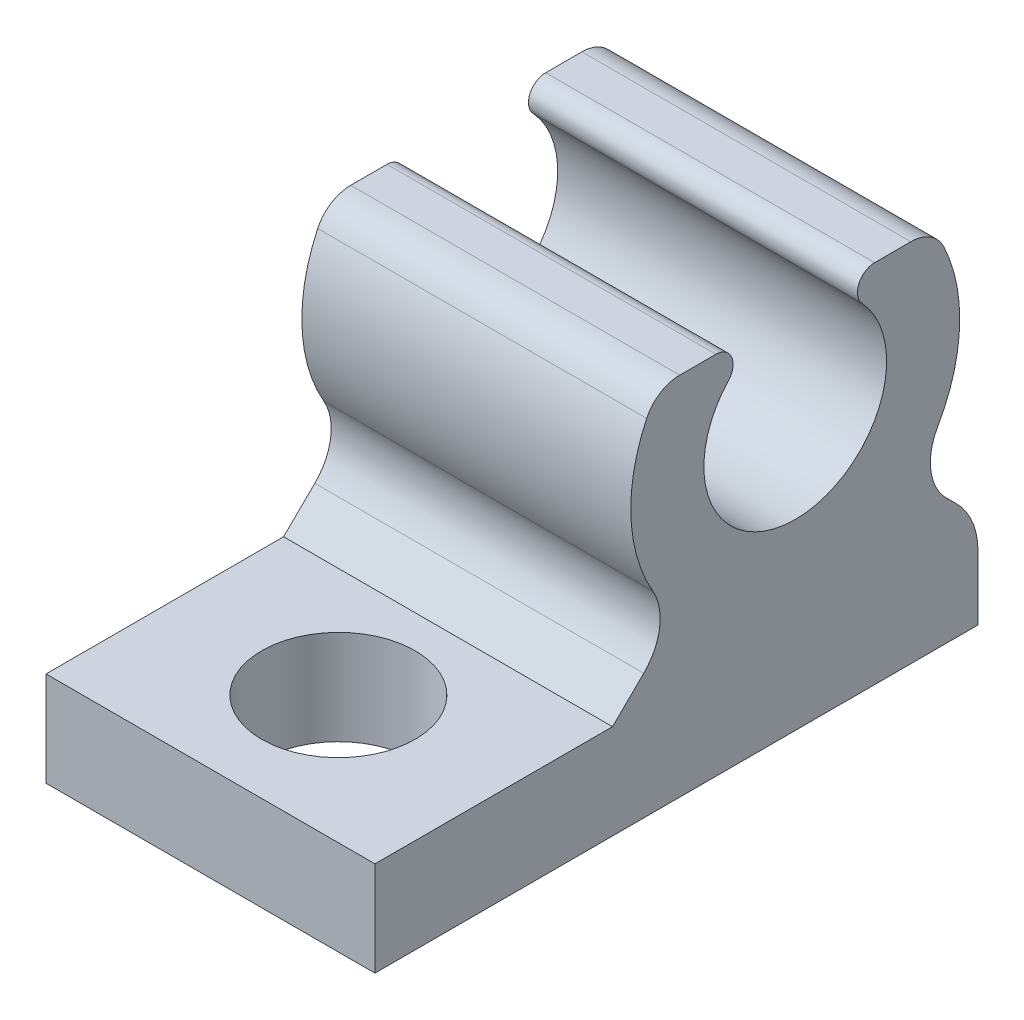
ISO-10303-21;
HEADER;
FILE_DESCRIPTION(('STEP AP214'),'2;1');
FILE_NAME('part.step','',(''),(''),'','','');
FILE_SCHEMA(('AUTOMOTIVE_DESIGN { 1 0 10303 214 1 1 1 1 }'));
ENDSEC;
DATA;
#1=APPLICATION_CONTEXT('core data for automotive mechanical design processes');
#2=APPLICATION_PROTOCOL_DEFINITION('international standard','automotive_design',2000,#1);
#3=PRODUCT_CONTEXT('',#1,'mechanical');
#4=PRODUCT('Part','Part','',(#3));
#5=PRODUCT_RELATED_PRODUCT_CATEGORY('part','',(#4));
#6=PRODUCT_DEFINITION_FORMATION('','',#4);
#7=PRODUCT_DEFINITION_CONTEXT('part definition',#1,'design');
#8=PRODUCT_DEFINITION('design','',#6,#7);
#9=PRODUCT_DEFINITION_SHAPE('','',#8);
#10=(LENGTH_UNIT() NAMED_UNIT(*) SI_UNIT(.MILLI.,.METRE.));
#11=(NAMED_UNIT(*) PLANE_ANGLE_UNIT() SI_UNIT($,.RADIAN.));
#12=(NAMED_UNIT(*) SI_UNIT($,.STERADIAN.) SOLID_ANGLE_UNIT());
#13=UNCERTAINTY_MEASURE_WITH_UNIT(LENGTH_MEASURE(1.E-05),#10,'distance_accuracy_value','');
#14=(GEOMETRIC_REPRESENTATION_CONTEXT(3) GLOBAL_UNCERTAINTY_ASSIGNED_CONTEXT((#13)) GLOBAL_UNIT_ASSIGNED_CONTEXT((#10,
#11,#12)) REPRESENTATION_CONTEXT('',''));
#15=CARTESIAN_POINT('',(0.,0.,0.));
#16=DIRECTION('',(0.,0.,1.));
#17=DIRECTION('',(1.,0.,0.));
#18=AXIS2_PLACEMENT_3D('',#15,#16,#17);
#19=CARTESIAN_POINT('',(-5.4,5.,-2.17157287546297));
#20=CARTESIAN_POINT('',(-5.10000000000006,5.,-2.17157287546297));
#21=CARTESIAN_POINT('',(-4.79999999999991,5.,-2.17157287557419));
#22=CARTESIAN_POINT('',(-1.50000000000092,5.,-2.17157287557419));
#23=CARTESIAN_POINT('',(1.50000000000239,5.,-2.17157287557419));
#24=CARTESIAN_POINT('',(4.79999999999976,5.,-2.17157287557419));
#25=CARTESIAN_POINT('',(5.10000000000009,5.,-2.17157287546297));
#26=CARTESIAN_POINT('',(5.39999999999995,5.,-2.17157287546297));
#27=CARTESIAN_POINT('',(-5.4,5.00000000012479,-1.69009893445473));
#28=CARTESIAN_POINT('',(-5.10000000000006,5.00000000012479,-1.69009893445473));
#29=CARTESIAN_POINT('',(-4.79999999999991,5.00000000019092,-1.69009893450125));
#30=CARTESIAN_POINT('',(-1.50000000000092,5.00000000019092,-1.69009893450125));
#31=CARTESIAN_POINT('',(1.50000000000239,5.00000000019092,-1.69009893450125));
#32=CARTESIAN_POINT('',(4.79999999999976,5.00000000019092,-1.69009893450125));
#33=CARTESIAN_POINT('',(5.10000000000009,5.00000000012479,-1.69009893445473));
#34=CARTESIAN_POINT('',(5.39999999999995,5.00000000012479,-1.69009893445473));
#35=CARTESIAN_POINT('',(-5.4,4.55837912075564,-1.49829654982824));
#36=CARTESIAN_POINT('',(-5.10000000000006,4.55837912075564,-1.49829654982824));
#37=CARTESIAN_POINT('',(-4.79999999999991,4.55837912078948,-1.49829654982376));
#38=CARTESIAN_POINT('',(-1.50000000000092,4.55837912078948,-1.49829654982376));
#39=CARTESIAN_POINT('',(1.50000000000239,4.55837912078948,-1.49829654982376));
#40=CARTESIAN_POINT('',(4.79999999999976,4.55837912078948,-1.49829654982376));
#41=CARTESIAN_POINT('',(5.10000000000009,4.55837912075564,-1.49829654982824));
#42=CARTESIAN_POINT('',(5.39999999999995,4.55837912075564,-1.49829654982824));
#43=CARTESIAN_POINT('',(-5.4,4.20652648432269,-1.82695576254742));
#44=CARTESIAN_POINT('',(-5.10000000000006,4.20652648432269,-1.82695576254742));
#45=CARTESIAN_POINT('',(-4.79999999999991,4.20652648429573,-1.82695576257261));
#46=CARTESIAN_POINT('',(-1.50000000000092,4.20652648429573,-1.82695576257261));
#47=CARTESIAN_POINT('',(1.50000000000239,4.20652648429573,-1.82695576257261));
#48=CARTESIAN_POINT('',(4.79999999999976,4.20652648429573,-1.82695576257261));
#49=CARTESIAN_POINT('',(5.10000000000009,4.20652648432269,-1.82695576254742));
#50=CARTESIAN_POINT('',(5.39999999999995,4.20652648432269,-1.82695576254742));
#51=(BOUNDED_SURFACE() B_SPLINE_SURFACE(3,3,((#19,#20,#21,#22,#23,#24,#25,#26),(#27,#28,#29,#30,
#31,#32,#33,#34),(#35,#36,#37,#38,#39,#40,#41,#42),(#43,#44,#45,#46,#47,#48,#49,#50)),
.UNSPECIFIED.,.F.,.F.,.F.) B_SPLINE_SURFACE_WITH_KNOTS((4,4),(4,2,2,4),(0.,1.),
(-0.0999999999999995,0.,0.999999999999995,1.09999999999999),
.UNSPECIFIED.) GEOMETRIC_REPRESENTATION_ITEM() RATIONAL_B_SPLINE_SURFACE(((1.,1.,1.,1.,1.,1.,1.,
1.),(0.598910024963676,0.598910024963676,0.598910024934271,0.598910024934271,0.598910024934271,
0.598910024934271,0.598910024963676,0.598910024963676),(0.598910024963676,0.598910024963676,
0.598910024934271,0.598910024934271,0.598910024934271,0.598910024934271,0.598910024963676,
0.598910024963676),(1.,1.,1.,1.,1.,1.,1.,1.))) REPRESENTATION_ITEM('') SURFACE());
#52=CARTESIAN_POINT('',(-5.4,4.20652648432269,-1.82695576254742));
#53=CARTESIAN_POINT('',(-5.10000000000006,4.20652648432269,-1.82695576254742));
#54=CARTESIAN_POINT('',(-4.79999999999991,4.20652648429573,-1.82695576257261));
#55=CARTESIAN_POINT('',(-1.50000000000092,4.20652648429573,-1.82695576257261));
#56=CARTESIAN_POINT('',(1.50000000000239,4.20652648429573,-1.82695576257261));
#57=CARTESIAN_POINT('',(4.79999999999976,4.20652648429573,-1.82695576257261));
#58=CARTESIAN_POINT('',(5.10000000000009,4.20652648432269,-1.82695576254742));
#59=CARTESIAN_POINT('',(5.39999999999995,4.20652648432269,-1.82695576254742));
#60=(BOUNDED_CURVE() B_SPLINE_CURVE(3,(#52,#53,#54,#55,#56,#57,#58,#59),.UNSPECIFIED.,.F.,
.F.) B_SPLINE_CURVE_WITH_KNOTS((4,2,2,4),(-0.0999999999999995,0.,0.999999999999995,
1.09999999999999),
.UNSPECIFIED.) CURVE() GEOMETRIC_REPRESENTATION_ITEM() RATIONAL_B_SPLINE_CURVE((1.,1.,1.,1.,1.,
1.,1.,1.)) REPRESENTATION_ITEM(''));
#61=CARTESIAN_POINT('',(4.5,4.20652648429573,-1.82695576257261));
#62=VERTEX_POINT('',#61);
#63=CARTESIAN_POINT('',(-4.5,4.20652648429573,-1.82695576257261));
#64=VERTEX_POINT('',#63);
#65=EDGE_CURVE('E461',#62,#64,#60,.F.);
#66=CARTESIAN_POINT('',(4.5,4.20652648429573,-1.82695576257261));
#67=CARTESIAN_POINT('',(4.5,4.55837912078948,-1.49829654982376));
#68=CARTESIAN_POINT('',(4.5,5.00000000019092,-1.69009893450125));
#69=CARTESIAN_POINT('',(4.5,5.,-2.17157287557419));
#70=(BOUNDED_CURVE() B_SPLINE_CURVE(3,(#66,#67,#68,#69),.UNSPECIFIED.,.F.,
.F.) B_SPLINE_CURVE_WITH_KNOTS((4,4),(0.,1.),
.UNSPECIFIED.) CURVE() GEOMETRIC_REPRESENTATION_ITEM() RATIONAL_B_SPLINE_CURVE((1.,
0.598910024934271,0.598910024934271,1.)) REPRESENTATION_ITEM(''));
#71=CARTESIAN_POINT('',(4.5,5.,-2.17157287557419));
#72=VERTEX_POINT('',#71);
#73=EDGE_CURVE('E385',#72,#62,#70,.F.);
#74=CARTESIAN_POINT('',(5.39999999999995,5.,-2.17157287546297));
#75=CARTESIAN_POINT('',(5.10000000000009,5.,-2.17157287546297));
#76=CARTESIAN_POINT('',(4.79999999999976,5.,-2.17157287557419));
#77=CARTESIAN_POINT('',(1.50000000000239,5.,-2.17157287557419));
#78=CARTESIAN_POINT('',(-1.50000000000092,5.,-2.17157287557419));
#79=CARTESIAN_POINT('',(-4.79999999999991,5.,-2.17157287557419));
#80=CARTESIAN_POINT('',(-5.10000000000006,5.,-2.17157287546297));
#81=CARTESIAN_POINT('',(-5.4,5.,-2.17157287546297));
#82=(BOUNDED_CURVE() B_SPLINE_CURVE(3,(#74,#75,#76,#77,#78,#79,#80,#81),.UNSPECIFIED.,.F.,
.F.) B_SPLINE_CURVE_WITH_KNOTS((4,2,2,4),(-0.0999999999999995,0.,0.999999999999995,
1.09999999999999),
.UNSPECIFIED.) CURVE() GEOMETRIC_REPRESENTATION_ITEM() RATIONAL_B_SPLINE_CURVE((1.,1.,1.,1.,1.,
1.,1.,1.)) REPRESENTATION_ITEM(''));
#83=CARTESIAN_POINT('',(-4.5,5.,-2.17157287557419));
#84=VERTEX_POINT('',#83);
#85=EDGE_CURVE('E459',#84,#72,#82,.F.);
#86=CARTESIAN_POINT('',(-4.5,5.,-2.17157287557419));
#87=CARTESIAN_POINT('',(-4.5,5.00000000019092,-1.69009893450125));
#88=CARTESIAN_POINT('',(-4.5,4.55837912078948,-1.49829654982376));
#89=CARTESIAN_POINT('',(-4.5,4.20652648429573,-1.82695576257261));
#90=(BOUNDED_CURVE() B_SPLINE_CURVE(3,(#86,#87,#88,#89),.UNSPECIFIED.,.F.,
.F.) B_SPLINE_CURVE_WITH_KNOTS((4,4),(0.,1.),
.UNSPECIFIED.) CURVE() GEOMETRIC_REPRESENTATION_ITEM() RATIONAL_B_SPLINE_CURVE((1.,
0.598910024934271,0.598910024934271,1.)) REPRESENTATION_ITEM(''));
#91=EDGE_CURVE('E382',#64,#84,#90,.F.);
#92=ORIENTED_EDGE('',*,*,#65,.F.);
#93=ORIENTED_EDGE('',*,*,#73,.F.);
#94=ORIENTED_EDGE('',*,*,#85,.F.);
#95=ORIENTED_EDGE('',*,*,#91,.F.);
#96=EDGE_LOOP('',(#92,#93,#94,#95));
#97=FACE_BOUND('',#96,.T.);
#98=ADVANCED_FACE('F38',(#97),#51,.T.);
#99=CARTESIAN_POINT('',(-5.4,4.20652648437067,1.8269557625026));
#100=CARTESIAN_POINT('',(-5.10000000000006,4.20652648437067,1.8269557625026));
#101=CARTESIAN_POINT('',(-4.79999999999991,4.20652648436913,1.82695576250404));
#102=CARTESIAN_POINT('',(-1.50000000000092,4.20652648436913,1.82695576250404));
#103=CARTESIAN_POINT('',(1.50000000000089,4.20652648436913,1.82695576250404));
#104=CARTESIAN_POINT('',(4.79999999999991,4.20652648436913,1.82695576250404));
#105=CARTESIAN_POINT('',(5.09999999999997,4.20652648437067,1.8269557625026));
#106=CARTESIAN_POINT('',(5.39999999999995,4.20652648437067,1.8269557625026));
#107=CARTESIAN_POINT('',(-5.4,4.55837912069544,1.49829654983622));
#108=CARTESIAN_POINT('',(-5.10000000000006,4.55837912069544,1.49829654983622));
#109=CARTESIAN_POINT('',(-4.79999999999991,4.55837912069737,1.49829654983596));
#110=CARTESIAN_POINT('',(-1.50000000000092,4.55837912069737,1.49829654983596));
#111=CARTESIAN_POINT('',(1.50000000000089,4.55837912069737,1.49829654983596));
#112=CARTESIAN_POINT('',(4.79999999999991,4.55837912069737,1.49829654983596));
#113=CARTESIAN_POINT('',(5.09999999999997,4.55837912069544,1.49829654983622));
#114=CARTESIAN_POINT('',(5.39999999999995,4.55837912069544,1.49829654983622));
#115=CARTESIAN_POINT('',(-5.4,5.00000000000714,1.69009893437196));
#116=CARTESIAN_POINT('',(-5.10000000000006,5.00000000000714,1.69009893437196));
#117=CARTESIAN_POINT('',(-4.79999999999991,5.00000000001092,1.69009893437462));
#118=CARTESIAN_POINT('',(-1.50000000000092,5.00000000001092,1.69009893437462));
#119=CARTESIAN_POINT('',(1.50000000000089,5.00000000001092,1.69009893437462));
#120=CARTESIAN_POINT('',(4.79999999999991,5.00000000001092,1.69009893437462));
#121=CARTESIAN_POINT('',(5.09999999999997,5.00000000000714,1.69009893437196));
#122=CARTESIAN_POINT('',(5.39999999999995,5.00000000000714,1.69009893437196));
#123=CARTESIAN_POINT('',(-5.4,5.,2.1715728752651));
#124=CARTESIAN_POINT('',(-5.10000000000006,5.,2.1715728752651));
#125=CARTESIAN_POINT('',(-4.79999999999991,5.,2.17157287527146));
#126=CARTESIAN_POINT('',(-1.50000000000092,5.,2.17157287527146));
#127=CARTESIAN_POINT('',(1.50000000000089,5.,2.17157287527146));
#128=CARTESIAN_POINT('',(4.79999999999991,5.,2.17157287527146));
#129=CARTESIAN_POINT('',(5.09999999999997,5.,2.1715728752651));
#130=CARTESIAN_POINT('',(5.39999999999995,5.,2.1715728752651));
#131=(BOUNDED_SURFACE() B_SPLINE_SURFACE(3,3,((#99,#100,#101,#102,#103,#104,#105,#106),(#107,
#108,#109,#110,#111,#112,#113,#114),(#115,#116,#117,#118,#119,#120,#121,#122),(#123,#124,#125,
#126,#127,#128,#129,#130)),.UNSPECIFIED.,.F.,.F.,.F.) B_SPLINE_SURFACE_WITH_KNOTS((4,4),(4,2,2,
4),(0.,1.),(-0.0999999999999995,0.,0.999999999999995,1.09999999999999),
.UNSPECIFIED.) GEOMETRIC_REPRESENTATION_ITEM() RATIONAL_B_SPLINE_SURFACE(((1.,1.,1.,1.,1.,1.,1.,
1.),(0.598910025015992,0.598910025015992,0.598910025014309,0.598910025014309,0.598910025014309,
0.598910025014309,0.598910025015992,0.598910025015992),(0.598910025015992,0.598910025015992,
0.598910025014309,0.598910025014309,0.598910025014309,0.598910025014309,0.598910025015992,
0.598910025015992),(1.,1.,1.,1.,1.,1.,1.,1.))) REPRESENTATION_ITEM('') SURFACE());
#132=CARTESIAN_POINT('',(5.39999999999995,4.20652648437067,1.8269557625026));
#133=CARTESIAN_POINT('',(5.09999999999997,4.20652648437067,1.8269557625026));
#134=CARTESIAN_POINT('',(4.79999999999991,4.20652648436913,1.82695576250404));
#135=CARTESIAN_POINT('',(1.50000000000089,4.20652648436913,1.82695576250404));
#136=CARTESIAN_POINT('',(-1.50000000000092,4.20652648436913,1.82695576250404));
#137=CARTESIAN_POINT('',(-4.79999999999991,4.20652648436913,1.82695576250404));
#138=CARTESIAN_POINT('',(-5.10000000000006,4.20652648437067,1.8269557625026));
#139=CARTESIAN_POINT('',(-5.4,4.20652648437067,1.8269557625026));
#140=(BOUNDED_CURVE() B_SPLINE_CURVE(3,(#132,#133,#134,#135,#136,#137,#138,#139),.UNSPECIFIED.,
.F.,.F.) B_SPLINE_CURVE_WITH_KNOTS((4,2,2,4),(-0.0999999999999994,0.,0.999999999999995,
1.09999999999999),
.UNSPECIFIED.) CURVE() GEOMETRIC_REPRESENTATION_ITEM() RATIONAL_B_SPLINE_CURVE((1.,1.,1.,1.,1.,
1.,1.,1.)) REPRESENTATION_ITEM(''));
#141=CARTESIAN_POINT('',(-4.5,4.20652648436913,1.82695576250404));
#142=VERTEX_POINT('',#141);
#143=CARTESIAN_POINT('',(4.5,4.20652648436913,1.82695576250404));
#144=VERTEX_POINT('',#143);
#145=EDGE_CURVE('E287',#142,#144,#140,.F.);
#146=CARTESIAN_POINT('',(-4.5,4.20652648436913,1.82695576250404));
#147=CARTESIAN_POINT('',(-4.5,4.55837912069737,1.49829654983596));
#148=CARTESIAN_POINT('',(-4.5,5.00000000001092,1.69009893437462));
#149=CARTESIAN_POINT('',(-4.5,5.,2.17157287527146));
#150=(BOUNDED_CURVE() B_SPLINE_CURVE(3,(#146,#147,#148,#149),.UNSPECIFIED.,.F.,
.F.) B_SPLINE_CURVE_WITH_KNOTS((4,4),(0.,1.),
.UNSPECIFIED.) CURVE() GEOMETRIC_REPRESENTATION_ITEM() RATIONAL_B_SPLINE_CURVE((1.,
0.598910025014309,0.598910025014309,1.)) REPRESENTATION_ITEM(''));
#151=CARTESIAN_POINT('',(-4.5,5.,2.17157287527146));
#152=VERTEX_POINT('',#151);
#153=EDGE_CURVE('E393',#152,#142,#150,.F.);
#154=CARTESIAN_POINT('',(-5.4,5.,2.1715728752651));
#155=CARTESIAN_POINT('',(-5.10000000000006,5.,2.1715728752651));
#156=CARTESIAN_POINT('',(-4.79999999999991,5.,2.17157287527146));
#157=CARTESIAN_POINT('',(-1.50000000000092,5.,2.17157287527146));
#158=CARTESIAN_POINT('',(1.50000000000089,5.,2.17157287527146));
#159=CARTESIAN_POINT('',(4.79999999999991,5.,2.17157287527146));
#160=CARTESIAN_POINT('',(5.09999999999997,5.,2.1715728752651));
#161=CARTESIAN_POINT('',(5.39999999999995,5.,2.1715728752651));
#162=(BOUNDED_CURVE() B_SPLINE_CURVE(3,(#154,#155,#156,#157,#158,#159,#160,#161),.UNSPECIFIED.,
.F.,.F.) B_SPLINE_CURVE_WITH_KNOTS((4,2,2,4),(-0.0999999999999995,0.,0.999999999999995,
1.09999999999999),
.UNSPECIFIED.) CURVE() GEOMETRIC_REPRESENTATION_ITEM() RATIONAL_B_SPLINE_CURVE((1.,1.,1.,1.,1.,
1.,1.,1.)) REPRESENTATION_ITEM(''));
#163=CARTESIAN_POINT('',(4.5,5.,2.17157287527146));
#164=VERTEX_POINT('',#163);
#165=EDGE_CURVE('E396',#164,#152,#162,.F.);
#166=CARTESIAN_POINT('',(4.5,5.,2.17157287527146));
#167=CARTESIAN_POINT('',(4.5,5.00000000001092,1.69009893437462));
#168=CARTESIAN_POINT('',(4.5,4.55837912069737,1.49829654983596));
#169=CARTESIAN_POINT('',(4.5,4.20652648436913,1.82695576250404));
#170=(BOUNDED_CURVE() B_SPLINE_CURVE(3,(#166,#167,#168,#169),.UNSPECIFIED.,.F.,
.F.) B_SPLINE_CURVE_WITH_KNOTS((4,4),(0.,1.),
.UNSPECIFIED.) CURVE() GEOMETRIC_REPRESENTATION_ITEM() RATIONAL_B_SPLINE_CURVE((1.,
0.598910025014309,0.598910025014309,1.)) REPRESENTATION_ITEM(''));
#171=EDGE_CURVE('E395',#144,#164,#170,.F.);
#172=ORIENTED_EDGE('',*,*,#145,.F.);
#173=ORIENTED_EDGE('',*,*,#153,.F.);
#174=ORIENTED_EDGE('',*,*,#165,.F.);
#175=ORIENTED_EDGE('',*,*,#171,.F.);
#176=EDGE_LOOP('',(#172,#173,#174,#175));
#177=FACE_BOUND('',#176,.T.);
#178=ADVANCED_FACE('F425',(#177),#131,.T.);
#179=CARTESIAN_POINT('',(-4.5,5.,5.));
#180=DIRECTION('',(0.,-1.,0.));
#181=DIRECTION('',(0.,0.,-1.));
#182=AXIS2_PLACEMENT_3D('',#179,#180,#181);
#183=PLANE('',#182);
#184=DIRECTION('',(0.,0.,-1.));
#185=VECTOR('',#184,1.);
#186=CARTESIAN_POINT('',(-4.5,5.,5.));
#187=LINE('',#186,#185);
#188=CARTESIAN_POINT('',(-4.5,5.,3.16227766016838));
#189=VERTEX_POINT('',#188);
#190=EDGE_CURVE('E328',#189,#152,#187,.T.);
#191=ORIENTED_EDGE('',*,*,#190,.F.);
#192=DIRECTION('',(-1.,0.,0.));
#193=VECTOR('',#192,1.);
#194=CARTESIAN_POINT('',(-4.5,5.,3.16227766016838));
#195=LINE('',#194,#193);
#196=CARTESIAN_POINT('',(4.5,5.,3.16227766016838));
#197=VERTEX_POINT('',#196);
#198=EDGE_CURVE('E361',#189,#197,#195,.F.);
#199=ORIENTED_EDGE('',*,*,#198,.T.);
#200=DIRECTION('',(0.,0.,-1.));
#201=VECTOR('',#200,1.);
#202=CARTESIAN_POINT('',(4.5,5.,5.));
#203=LINE('',#202,#201);
#204=EDGE_CURVE('E353',#197,#164,#203,.T.);
#205=ORIENTED_EDGE('',*,*,#204,.T.);
#206=ORIENTED_EDGE('',*,*,#165,.T.);
#207=EDGE_LOOP('',(#191,#199,#205,#206));
#208=FACE_BOUND('',#207,.T.);
#209=ADVANCED_FACE('F529',(#208),#183,.F.);
#210=CARTESIAN_POINT('',(4.5,5.,5.));
#211=DIRECTION('',(-1.,0.,0.));
#212=DIRECTION('',(0.,-1.,0.));
#213=AXIS2_PLACEMENT_3D('',#210,#211,#212);
#214=PLANE('',#213);
#215=DIRECTION('',(0.,1.,0.));
#216=VECTOR('',#215,1.);
#217=CARTESIAN_POINT('',(4.5,5.,-5.));
#218=LINE('',#217,#216);
#219=CARTESIAN_POINT('',(4.5,-5.,-5.));
#220=VERTEX_POINT('',#219);
#221=CARTESIAN_POINT('',(4.5,-3.24876140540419,-5.));
#222=VERTEX_POINT('',#221);
#223=EDGE_CURVE('E380',#220,#222,#218,.T.);
#224=ORIENTED_EDGE('',*,*,#223,.T.);
#225=CARTESIAN_POINT('',(4.5,-3.24876140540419,-3.));
#226=DIRECTION('',(-1.,0.,0.));
#227=DIRECTION('',(0.,-1.,0.));
#228=AXIS2_PLACEMENT_3D('',#225,#226,#227);
#229=CIRCLE('',#228,2.);
#230=CARTESIAN_POINT('',(4.5,-1.82171042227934,-4.40125853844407));
#231=VERTEX_POINT('',#230);
#232=EDGE_CURVE('E67',#222,#231,#229,.F.);
#233=ORIENTED_EDGE('',*,*,#232,.T.);
#234=DIRECTION('',(0.,0.700629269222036,0.713525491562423));
#235=VECTOR('',#234,1.);
#236=CARTESIAN_POINT('',(4.5,6.22678765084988,3.79538524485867));
#237=LINE('',#236,#235);
#238=CARTESIAN_POINT('',(4.5,-1.57028823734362,-4.14520851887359));
#239=VERTEX_POINT('',#238);
#240=EDGE_CURVE('E251',#231,#239,#237,.T.);
#241=ORIENTED_EDGE('',*,*,#240,.T.);
#242=CARTESIAN_POINT('',(4.5,-0.499999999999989,-5.19615242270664));
#243=DIRECTION('',(-1.,0.,0.));
#244=DIRECTION('',(0.,-1.,0.));
#245=AXIS2_PLACEMENT_3D('',#242,#243,#244);
#246=CIRCLE('',#245,1.5);
#247=CARTESIAN_POINT('',(4.5,0.250000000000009,-3.89711431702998));
#248=VERTEX_POINT('',#247);
#249=EDGE_CURVE('E266',#239,#248,#246,.T.);
#250=ORIENTED_EDGE('',*,*,#249,.T.);
#251=CARTESIAN_POINT('',(4.5,2.5,0.));
#252=DIRECTION('',(-1.,0.,0.));
#253=DIRECTION('',(0.,-1.,0.));
#254=AXIS2_PLACEMENT_3D('',#251,#252,#253);
#255=CIRCLE('',#254,4.5);
#256=CARTESIAN_POINT('',(4.5,4.42857142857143,-4.06578556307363));
#257=VERTEX_POINT('',#256);
#258=EDGE_CURVE('E265',#248,#257,#255,.F.);
#259=ORIENTED_EDGE('',*,*,#258,.T.);
#260=CARTESIAN_POINT('',(4.5,4.,-3.16227766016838));
#261=DIRECTION('',(-1.,0.,0.));
#262=DIRECTION('',(0.,-1.,0.));
#263=AXIS2_PLACEMENT_3D('',#260,#261,#262);
#264=CIRCLE('',#263,1.);
#265=CARTESIAN_POINT('',(4.5,5.,-3.16227766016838));
#266=VERTEX_POINT('',#265);
#267=EDGE_CURVE('E358',#257,#266,#264,.F.);
#268=ORIENTED_EDGE('',*,*,#267,.T.);
#269=EDGE_CURVE('E330',#72,#266,#203,.T.);
#270=ORIENTED_EDGE('',*,*,#269,.F.);
#271=ORIENTED_EDGE('',*,*,#73,.T.);
#272=CARTESIAN_POINT('',(4.5,2.5,0.));
#273=DIRECTION('',(1.,0.,0.));
#274=DIRECTION('',(0.,0.,-1.));
#275=AXIS2_PLACEMENT_3D('',#272,#273,#274);
#276=CIRCLE('',#275,2.5);
#277=EDGE_CURVE('E270',#144,#62,#276,.T.);
#278=ORIENTED_EDGE('',*,*,#277,.F.);
#279=ORIENTED_EDGE('',*,*,#171,.T.);
#280=ORIENTED_EDGE('',*,*,#204,.F.);
#281=CARTESIAN_POINT('',(4.5,4.,3.16227766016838));
#282=DIRECTION('',(-1.,0.,0.));
#283=DIRECTION('',(0.,-1.,0.));
#284=AXIS2_PLACEMENT_3D('',#281,#282,#283);
#285=CIRCLE('',#284,1.);
#286=CARTESIAN_POINT('',(4.5,4.42857142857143,4.06578556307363));
#287=VERTEX_POINT('',#286);
#288=EDGE_CURVE('E352',#197,#287,#285,.F.);
#289=ORIENTED_EDGE('',*,*,#288,.T.);
#290=CARTESIAN_POINT('',(4.5,0.250000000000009,3.89711431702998));
#291=VERTEX_POINT('',#290);
#292=EDGE_CURVE('E262',#287,#291,#255,.F.);
#293=ORIENTED_EDGE('',*,*,#292,.T.);
#294=CARTESIAN_POINT('',(4.5,-0.499999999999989,5.19615242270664));
#295=DIRECTION('',(-1.,0.,0.));
#296=DIRECTION('',(0.,-1.,0.));
#297=AXIS2_PLACEMENT_3D('',#294,#295,#296);
#298=CIRCLE('',#297,1.5);
#299=CARTESIAN_POINT('',(4.5,-1.57028823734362,4.14520851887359));
#300=VERTEX_POINT('',#299);
#301=EDGE_CURVE('E259',#291,#300,#298,.T.);
#302=ORIENTED_EDGE('',*,*,#301,.T.);
#303=DIRECTION('',(0.,-0.700629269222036,0.713525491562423));
#304=VECTOR('',#303,1.);
#305=CARTESIAN_POINT('',(4.5,1.22761921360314,1.2958010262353));
#306=LINE('',#305,#304);
#307=CARTESIAN_POINT('',(4.5,-2.40963026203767,5.));
#308=VERTEX_POINT('',#307);
#309=EDGE_CURVE('E223',#300,#308,#306,.T.);
#310=ORIENTED_EDGE('',*,*,#309,.T.);
#311=DIRECTION('',(0.,0.,-1.));
#312=VECTOR('',#311,1.);
#313=CARTESIAN_POINT('',(4.5,-2.40963026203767,11.5));
#314=LINE('',#313,#312);
#315=CARTESIAN_POINT('',(4.5,-2.40963026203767,11.5));
#316=VERTEX_POINT('',#315);
#317=EDGE_CURVE('E201',#316,#308,#314,.T.);
#318=ORIENTED_EDGE('',*,*,#317,.F.);
#319=DIRECTION('',(0.,1.,0.));
#320=VECTOR('',#319,1.);
#321=CARTESIAN_POINT('',(4.5,-5.,11.5));
#322=LINE('',#321,#320);
#323=CARTESIAN_POINT('',(4.5,-5.,11.5));
#324=VERTEX_POINT('',#323);
#325=EDGE_CURVE('E209',#324,#316,#322,.T.);
#326=ORIENTED_EDGE('',*,*,#325,.F.);
#327=DIRECTION('',(0.,0.,-1.));
#328=VECTOR('',#327,1.);
#329=CARTESIAN_POINT('',(4.5,-5.,5.));
#330=LINE('',#329,#328);
#331=EDGE_CURVE('E377',#324,#220,#330,.T.);
#332=ORIENTED_EDGE('',*,*,#331,.T.);
#333=EDGE_LOOP('',(#224,#233,#241,#250,#259,#268,#270,#271,#278,#279,#280,#289,#293,#302,#310,
#318,#326,#332));
#334=FACE_BOUND('',#333,.T.);
#335=ADVANCED_FACE('F221',(#334),#214,.F.);
#336=ORIENTED_EDGE('',*,*,#269,.T.);
#337=DIRECTION('',(-1.,0.,0.));
#338=VECTOR('',#337,1.);
#339=CARTESIAN_POINT('',(-4.5,5.,-3.16227766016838));
#340=LINE('',#339,#338);
#341=CARTESIAN_POINT('',(-4.5,5.,-3.16227766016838));
#342=VERTEX_POINT('',#341);
#343=EDGE_CURVE('E341',#266,#342,#340,.T.);
#344=ORIENTED_EDGE('',*,*,#343,.T.);
#345=EDGE_CURVE('E318',#84,#342,#187,.T.);
#346=ORIENTED_EDGE('',*,*,#345,.F.);
#347=ORIENTED_EDGE('',*,*,#85,.T.);
#348=EDGE_LOOP('',(#336,#344,#346,#347));
#349=FACE_BOUND('',#348,.T.);
#350=ADVANCED_FACE('F467',(#349),#183,.F.);
#351=CARTESIAN_POINT('',(-4.5,5.,5.));
#352=DIRECTION('',(1.,0.,0.));
#353=DIRECTION('',(0.,1.,0.));
#354=AXIS2_PLACEMENT_3D('',#351,#352,#353);
#355=PLANE('',#354);
#356=DIRECTION('',(0.,-0.700629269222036,-0.713525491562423));
#357=VECTOR('',#356,1.);
#358=CARTESIAN_POINT('',(-4.5,6.22678765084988,3.79538524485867));
#359=LINE('',#358,#357);
#360=CARTESIAN_POINT('',(-4.5,-1.57028823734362,-4.14520851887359));
#361=VERTEX_POINT('',#360);
#362=CARTESIAN_POINT('',(-4.5,-1.82171042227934,-4.40125853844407));
#363=VERTEX_POINT('',#362);
#364=EDGE_CURVE('E248',#361,#363,#359,.T.);
#365=ORIENTED_EDGE('',*,*,#364,.T.);
#366=CARTESIAN_POINT('',(-4.5,-3.24876140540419,-3.));
#367=DIRECTION('',(1.,0.,0.));
#368=DIRECTION('',(0.,1.,0.));
#369=AXIS2_PLACEMENT_3D('',#366,#367,#368);
#370=CIRCLE('',#369,2.);
#371=CARTESIAN_POINT('',(-4.5,-3.24876140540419,-5.));
#372=VERTEX_POINT('',#371);
#373=EDGE_CURVE('E11',#363,#372,#370,.F.);
#374=ORIENTED_EDGE('',*,*,#373,.T.);
#375=DIRECTION('',(0.,-1.,0.));
#376=VECTOR('',#375,1.);
#377=CARTESIAN_POINT('',(-4.5,5.,-5.));
#378=LINE('',#377,#376);
#379=CARTESIAN_POINT('',(-4.5,-5.,-5.));
#380=VERTEX_POINT('',#379);
#381=EDGE_CURVE('E378',#372,#380,#378,.T.);
#382=ORIENTED_EDGE('',*,*,#381,.T.);
#383=DIRECTION('',(0.,0.,-1.));
#384=VECTOR('',#383,1.);
#385=CARTESIAN_POINT('',(-4.5,-5.,5.));
#386=LINE('',#385,#384);
#387=CARTESIAN_POINT('',(-4.5,-5.,11.5));
#388=VERTEX_POINT('',#387);
#389=EDGE_CURVE('E329',#388,#380,#386,.T.);
#390=ORIENTED_EDGE('',*,*,#389,.F.);
#391=DIRECTION('',(0.,-1.,0.));
#392=VECTOR('',#391,1.);
#393=CARTESIAN_POINT('',(-4.5,-2.40963026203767,11.5));
#394=LINE('',#393,#392);
#395=CARTESIAN_POINT('',(-4.5,-2.40963026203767,11.5));
#396=VERTEX_POINT('',#395);
#397=EDGE_CURVE('E208',#396,#388,#394,.T.);
#398=ORIENTED_EDGE('',*,*,#397,.F.);
#399=DIRECTION('',(0.,0.,-1.));
#400=VECTOR('',#399,1.);
#401=CARTESIAN_POINT('',(-4.5,-2.40963026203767,11.5));
#402=LINE('',#401,#400);
#403=CARTESIAN_POINT('',(-4.5,-2.40963026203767,5.));
#404=VERTEX_POINT('',#403);
#405=EDGE_CURVE('E203',#396,#404,#402,.T.);
#406=ORIENTED_EDGE('',*,*,#405,.T.);
#407=DIRECTION('',(0.,0.700629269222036,-0.713525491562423));
#408=VECTOR('',#407,1.);
#409=CARTESIAN_POINT('',(-4.5,1.22761921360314,1.2958010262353));
#410=LINE('',#409,#408);
#411=CARTESIAN_POINT('',(-4.5,-1.57028823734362,4.14520851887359));
#412=VERTEX_POINT('',#411);
#413=EDGE_CURVE('E254',#404,#412,#410,.T.);
#414=ORIENTED_EDGE('',*,*,#413,.T.);
#415=CARTESIAN_POINT('',(-4.5,-0.499999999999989,5.19615242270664));
#416=DIRECTION('',(1.,0.,0.));
#417=DIRECTION('',(0.,1.,0.));
#418=AXIS2_PLACEMENT_3D('',#415,#416,#417);
#419=CIRCLE('',#418,1.5);
#420=CARTESIAN_POINT('',(-4.5,0.250000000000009,3.89711431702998));
#421=VERTEX_POINT('',#420);
#422=EDGE_CURVE('E399',#412,#421,#419,.T.);
#423=ORIENTED_EDGE('',*,*,#422,.T.);
#424=CARTESIAN_POINT('',(-4.5,2.5,0.));
#425=DIRECTION('',(1.,0.,0.));
#426=DIRECTION('',(0.,1.,0.));
#427=AXIS2_PLACEMENT_3D('',#424,#425,#426);
#428=CIRCLE('',#427,4.5);
#429=CARTESIAN_POINT('',(-4.5,4.42857142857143,4.06578556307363));
#430=VERTEX_POINT('',#429);
#431=EDGE_CURVE('E388',#421,#430,#428,.F.);
#432=ORIENTED_EDGE('',*,*,#431,.T.);
#433=CARTESIAN_POINT('',(-4.5,4.,3.16227766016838));
#434=DIRECTION('',(1.,0.,0.));
#435=DIRECTION('',(0.,1.,0.));
#436=AXIS2_PLACEMENT_3D('',#433,#434,#435);
#437=CIRCLE('',#436,1.);
#438=EDGE_CURVE('E343',#430,#189,#437,.F.);
#439=ORIENTED_EDGE('',*,*,#438,.T.);
#440=ORIENTED_EDGE('',*,*,#190,.T.);
#441=ORIENTED_EDGE('',*,*,#153,.T.);
#442=CARTESIAN_POINT('',(-4.5,2.5,0.));
#443=DIRECTION('',(1.,0.,0.));
#444=DIRECTION('',(0.,0.,-1.));
#445=AXIS2_PLACEMENT_3D('',#442,#443,#444);
#446=CIRCLE('',#445,2.5);
#447=EDGE_CURVE('E280',#142,#64,#446,.T.);
#448=ORIENTED_EDGE('',*,*,#447,.T.);
#449=ORIENTED_EDGE('',*,*,#91,.T.);
#450=ORIENTED_EDGE('',*,*,#345,.T.);
#451=CARTESIAN_POINT('',(-4.5,4.,-3.16227766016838));
#452=DIRECTION('',(1.,0.,0.));
#453=DIRECTION('',(0.,1.,0.));
#454=AXIS2_PLACEMENT_3D('',#451,#452,#453);
#455=CIRCLE('',#454,1.);
#456=CARTESIAN_POINT('',(-4.5,4.42857142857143,-4.06578556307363));
#457=VERTEX_POINT('',#456);
#458=EDGE_CURVE('E346',#342,#457,#455,.F.);
#459=ORIENTED_EDGE('',*,*,#458,.T.);
#460=CARTESIAN_POINT('',(-4.5,0.250000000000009,-3.89711431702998));
#461=VERTEX_POINT('',#460);
#462=EDGE_CURVE('E386',#457,#461,#428,.F.);
#463=ORIENTED_EDGE('',*,*,#462,.T.);
#464=CARTESIAN_POINT('',(-4.5,-0.499999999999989,-5.19615242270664));
#465=DIRECTION('',(1.,0.,0.));
#466=DIRECTION('',(0.,1.,0.));
#467=AXIS2_PLACEMENT_3D('',#464,#465,#466);
#468=CIRCLE('',#467,1.5);
#469=EDGE_CURVE('E387',#461,#361,#468,.T.);
#470=ORIENTED_EDGE('',*,*,#469,.T.);
#471=EDGE_LOOP('',(#365,#374,#382,#390,#398,#406,#414,#423,#432,#439,#440,#441,#448,#449,#450,
#459,#463,#470));
#472=FACE_BOUND('',#471,.T.);
#473=ADVANCED_FACE('F483',(#472),#355,.F.);
#474=CARTESIAN_POINT('',(-4.5,-5.,5.));
#475=DIRECTION('',(0.,1.,0.));
#476=DIRECTION('',(0.,0.,1.));
#477=AXIS2_PLACEMENT_3D('',#474,#475,#476);
#478=PLANE('',#477);
#479=CARTESIAN_POINT('',(0.,-5.,8.));
#480=DIRECTION('',(0.,1.,0.));
#481=DIRECTION('',(0.,0.,1.));
#482=AXIS2_PLACEMENT_3D('',#479,#480,#481);
#483=CIRCLE('',#482,2.1);
#484=CARTESIAN_POINT('',(0.,-5.,10.1));
#485=VERTEX_POINT('',#484);
#486=EDGE_CURVE('E218',#485,#485,#483,.T.);
#487=ORIENTED_EDGE('',*,*,#486,.T.);
#488=EDGE_LOOP('',(#487));
#489=FACE_BOUND('',#488,.T.);
#490=DIRECTION('',(1.,0.,0.));
#491=VECTOR('',#490,1.);
#492=CARTESIAN_POINT('',(-4.5,-5.,-5.));
#493=LINE('',#492,#491);
#494=EDGE_CURVE('E375',#380,#220,#493,.T.);
#495=ORIENTED_EDGE('',*,*,#494,.T.);
#496=ORIENTED_EDGE('',*,*,#331,.F.);
#497=DIRECTION('',(1.,0.,0.));
#498=VECTOR('',#497,1.);
#499=CARTESIAN_POINT('',(-4.5,-5.,11.5));
#500=LINE('',#499,#498);
#501=EDGE_CURVE('E215',#388,#324,#500,.T.);
#502=ORIENTED_EDGE('',*,*,#501,.F.);
#503=ORIENTED_EDGE('',*,*,#389,.T.);
#504=EDGE_LOOP('',(#495,#496,#502,#503));
#505=FACE_BOUND('',#504,.T.);
#506=ADVANCED_FACE('F501',(#489,#505),#478,.F.);
#507=CARTESIAN_POINT('',(4.5,-5.,-5.));
#508=DIRECTION('',(0.,0.,1.));
#509=DIRECTION('',(1.,0.,0.));
#510=AXIS2_PLACEMENT_3D('',#507,#508,#509);
#511=PLANE('',#510);
#512=ORIENTED_EDGE('',*,*,#381,.F.);
#513=DIRECTION('',(1.,0.,0.));
#514=VECTOR('',#513,1.);
#515=CARTESIAN_POINT('',(4.5,-3.24876140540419,-5.));
#516=LINE('',#515,#514);
#517=EDGE_CURVE('E368',#372,#222,#516,.T.);
#518=ORIENTED_EDGE('',*,*,#517,.T.);
#519=ORIENTED_EDGE('',*,*,#223,.F.);
#520=ORIENTED_EDGE('',*,*,#494,.F.);
#521=EDGE_LOOP('',(#512,#518,#519,#520));
#522=FACE_BOUND('',#521,.T.);
#523=ADVANCED_FACE('F306',(#522),#511,.F.);
#524=CARTESIAN_POINT('',(-4.5,2.5,0.));
#525=DIRECTION('',(1.,0.,0.));
#526=DIRECTION('',(0.,0.,-1.));
#527=AXIS2_PLACEMENT_3D('',#524,#525,#526);
#528=CYLINDRICAL_SURFACE('',#527,2.5);
#529=ORIENTED_EDGE('',*,*,#277,.T.);
#530=ORIENTED_EDGE('',*,*,#65,.T.);
#531=ORIENTED_EDGE('',*,*,#447,.F.);
#532=ORIENTED_EDGE('',*,*,#145,.T.);
#533=EDGE_LOOP('',(#529,#530,#531,#532));
#534=FACE_BOUND('',#533,.T.);
#535=ADVANCED_FACE('F295',(#534),#528,.F.);
#536=CARTESIAN_POINT('',(25.6634635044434,2.5,0.));
#537=DIRECTION('',(-1.,0.,0.));
#538=DIRECTION('',(0.,0.,1.));
#539=AXIS2_PLACEMENT_3D('',#536,#537,#538);
#540=CYLINDRICAL_SURFACE('',#539,4.5);
#541=ORIENTED_EDGE('',*,*,#462,.F.);
#542=DIRECTION('',(-1.,0.,0.));
#543=VECTOR('',#542,1.);
#544=CARTESIAN_POINT('',(25.6634635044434,4.42857142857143,-4.06578556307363));
#545=LINE('',#544,#543);
#546=EDGE_CURVE('E349',#457,#257,#545,.F.);
#547=ORIENTED_EDGE('',*,*,#546,.T.);
#548=ORIENTED_EDGE('',*,*,#258,.F.);
#549=DIRECTION('',(-1.,0.,0.));
#550=VECTOR('',#549,1.);
#551=CARTESIAN_POINT('',(25.6634635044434,0.250000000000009,-3.89711431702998));
#552=LINE('',#551,#550);
#553=EDGE_CURVE('E240',#248,#461,#552,.T.);
#554=ORIENTED_EDGE('',*,*,#553,.T.);
#555=EDGE_LOOP('',(#541,#547,#548,#554));
#556=FACE_BOUND('',#555,.T.);
#557=ADVANCED_FACE('F305',(#556),#540,.T.);
#558=CARTESIAN_POINT('',(25.6634635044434,-1.57028823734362,-4.14520851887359));
#559=DIRECTION('',(0.,-0.713525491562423,0.700629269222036));
#560=DIRECTION('',(0.,-0.700629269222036,-0.713525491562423));
#561=AXIS2_PLACEMENT_3D('',#558,#559,#560);
#562=PLANE('',#561);
#563=ORIENTED_EDGE('',*,*,#240,.F.);
#564=DIRECTION('',(1.,0.,0.));
#565=VECTOR('',#564,1.);
#566=CARTESIAN_POINT('',(25.6634635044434,-1.82171042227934,-4.40125853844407));
#567=LINE('',#566,#565);
#568=EDGE_CURVE('E47',#231,#363,#567,.F.);
#569=ORIENTED_EDGE('',*,*,#568,.T.);
#570=ORIENTED_EDGE('',*,*,#364,.F.);
#571=DIRECTION('',(-1.,0.,0.));
#572=VECTOR('',#571,1.);
#573=CARTESIAN_POINT('',(25.6634635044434,-1.57028823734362,-4.14520851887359));
#574=LINE('',#573,#572);
#575=EDGE_CURVE('E244',#239,#361,#574,.T.);
#576=ORIENTED_EDGE('',*,*,#575,.F.);
#577=EDGE_LOOP('',(#563,#569,#570,#576));
#578=FACE_BOUND('',#577,.T.);
#579=ADVANCED_FACE('F307',(#578),#562,.F.);
#580=CARTESIAN_POINT('',(25.6634635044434,-0.499999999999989,-5.19615242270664));
#581=DIRECTION('',(-1.,0.,0.));
#582=DIRECTION('',(0.,0.,1.));
#583=AXIS2_PLACEMENT_3D('',#580,#581,#582);
#584=CYLINDRICAL_SURFACE('',#583,1.5);
#585=ORIENTED_EDGE('',*,*,#249,.F.);
#586=ORIENTED_EDGE('',*,*,#575,.T.);
#587=ORIENTED_EDGE('',*,*,#469,.F.);
#588=ORIENTED_EDGE('',*,*,#553,.F.);
#589=EDGE_LOOP('',(#585,#586,#587,#588));
#590=FACE_BOUND('',#589,.T.);
#591=ADVANCED_FACE('F591',(#590),#584,.F.);
#592=ORIENTED_EDGE('',*,*,#292,.F.);
#593=DIRECTION('',(-1.,0.,0.));
#594=VECTOR('',#593,1.);
#595=CARTESIAN_POINT('',(25.6634635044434,4.42857142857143,4.06578556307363));
#596=LINE('',#595,#594);
#597=EDGE_CURVE('E365',#287,#430,#596,.T.);
#598=ORIENTED_EDGE('',*,*,#597,.T.);
#599=ORIENTED_EDGE('',*,*,#431,.F.);
#600=DIRECTION('',(-1.,0.,0.));
#601=VECTOR('',#600,1.);
#602=CARTESIAN_POINT('',(25.6634635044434,0.250000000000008,3.89711431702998));
#603=LINE('',#602,#601);
#604=EDGE_CURVE('E231',#291,#421,#603,.T.);
#605=ORIENTED_EDGE('',*,*,#604,.F.);
#606=EDGE_LOOP('',(#592,#598,#599,#605));
#607=FACE_BOUND('',#606,.T.);
#608=ADVANCED_FACE('F551',(#607),#540,.T.);
#609=CARTESIAN_POINT('',(25.6634635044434,-0.499999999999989,5.19615242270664));
#610=DIRECTION('',(-1.,0.,0.));
#611=DIRECTION('',(0.,0.,1.));
#612=AXIS2_PLACEMENT_3D('',#609,#610,#611);
#613=CYLINDRICAL_SURFACE('',#612,1.5);
#614=ORIENTED_EDGE('',*,*,#301,.F.);
#615=ORIENTED_EDGE('',*,*,#604,.T.);
#616=ORIENTED_EDGE('',*,*,#422,.F.);
#617=DIRECTION('',(-1.,0.,0.));
#618=VECTOR('',#617,1.);
#619=CARTESIAN_POINT('',(25.6634635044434,-1.57028823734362,4.14520851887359));
#620=LINE('',#619,#618);
#621=EDGE_CURVE('E225',#300,#412,#620,.T.);
#622=ORIENTED_EDGE('',*,*,#621,.F.);
#623=EDGE_LOOP('',(#614,#615,#616,#622));
#624=FACE_BOUND('',#623,.T.);
#625=ADVANCED_FACE('F553',(#624),#613,.F.);
#626=CARTESIAN_POINT('',(25.6634635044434,-1.57028823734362,4.14520851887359));
#627=DIRECTION('',(0.,-0.713525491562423,-0.700629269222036));
#628=DIRECTION('',(0.,0.700629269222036,-0.713525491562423));
#629=AXIS2_PLACEMENT_3D('',#626,#627,#628);
#630=PLANE('',#629);
#631=ORIENTED_EDGE('',*,*,#309,.F.);
#632=ORIENTED_EDGE('',*,*,#621,.T.);
#633=ORIENTED_EDGE('',*,*,#413,.F.);
#634=DIRECTION('',(1.,0.,0.));
#635=VECTOR('',#634,1.);
#636=CARTESIAN_POINT('',(4.5,-2.40963026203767,5.));
#637=LINE('',#636,#635);
#638=EDGE_CURVE('E384',#404,#308,#637,.T.);
#639=ORIENTED_EDGE('',*,*,#638,.T.);
#640=EDGE_LOOP('',(#631,#632,#633,#639));
#641=FACE_BOUND('',#640,.T.);
#642=ADVANCED_FACE('F556',(#641),#630,.F.);
#643=CARTESIAN_POINT('',(25.6634635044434,4.,-3.16227766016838));
#644=DIRECTION('',(-1.,0.,0.));
#645=DIRECTION('',(0.,0.,1.));
#646=AXIS2_PLACEMENT_3D('',#643,#644,#645);
#647=CYLINDRICAL_SURFACE('',#646,1.);
#648=ORIENTED_EDGE('',*,*,#267,.F.);
#649=ORIENTED_EDGE('',*,*,#546,.F.);
#650=ORIENTED_EDGE('',*,*,#458,.F.);
#651=ORIENTED_EDGE('',*,*,#343,.F.);
#652=EDGE_LOOP('',(#648,#649,#650,#651));
#653=FACE_BOUND('',#652,.T.);
#654=ADVANCED_FACE('F431',(#653),#647,.T.);
#655=CARTESIAN_POINT('',(25.6634635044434,4.,3.16227766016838));
#656=DIRECTION('',(-1.,0.,0.));
#657=DIRECTION('',(0.,0.,1.));
#658=AXIS2_PLACEMENT_3D('',#655,#656,#657);
#659=CYLINDRICAL_SURFACE('',#658,1.);
#660=ORIENTED_EDGE('',*,*,#438,.F.);
#661=ORIENTED_EDGE('',*,*,#597,.F.);
#662=ORIENTED_EDGE('',*,*,#288,.F.);
#663=ORIENTED_EDGE('',*,*,#198,.F.);
#664=EDGE_LOOP('',(#660,#661,#662,#663));
#665=FACE_BOUND('',#664,.T.);
#666=ADVANCED_FACE('F545',(#665),#659,.T.);
#667=CARTESIAN_POINT('',(4.5,-2.40963026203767,11.5));
#668=DIRECTION('',(0.,-1.,0.));
#669=DIRECTION('',(1.,0.,0.));
#670=AXIS2_PLACEMENT_3D('',#667,#668,#669);
#671=PLANE('',#670);
#672=CARTESIAN_POINT('',(0.,-2.40963026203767,8.));
#673=DIRECTION('',(0.,1.,0.));
#674=DIRECTION('',(0.,0.,1.));
#675=AXIS2_PLACEMENT_3D('',#672,#673,#674);
#676=CIRCLE('',#675,2.1);
#677=CARTESIAN_POINT('',(0.,-2.40963026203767,10.1));
#678=VERTEX_POINT('',#677);
#679=EDGE_CURVE('E562',#678,#678,#676,.T.);
#680=ORIENTED_EDGE('',*,*,#679,.F.);
#681=EDGE_LOOP('',(#680));
#682=FACE_BOUND('',#681,.T.);
#683=ORIENTED_EDGE('',*,*,#638,.F.);
#684=ORIENTED_EDGE('',*,*,#405,.F.);
#685=DIRECTION('',(-1.,0.,0.));
#686=VECTOR('',#685,1.);
#687=CARTESIAN_POINT('',(4.5,-2.40963026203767,11.5));
#688=LINE('',#687,#686);
#689=EDGE_CURVE('E196',#316,#396,#688,.T.);
#690=ORIENTED_EDGE('',*,*,#689,.F.);
#691=ORIENTED_EDGE('',*,*,#317,.T.);
#692=EDGE_LOOP('',(#683,#684,#690,#691));
#693=FACE_BOUND('',#692,.T.);
#694=ADVANCED_FACE('F199',(#682,#693),#671,.F.);
#695=CARTESIAN_POINT('',(4.5,-2.40963026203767,11.5));
#696=DIRECTION('',(0.,0.,1.));
#697=DIRECTION('',(1.,0.,0.));
#698=AXIS2_PLACEMENT_3D('',#695,#696,#697);
#699=PLANE('',#698);
#700=ORIENTED_EDGE('',*,*,#325,.T.);
#701=ORIENTED_EDGE('',*,*,#689,.T.);
#702=ORIENTED_EDGE('',*,*,#397,.T.);
#703=ORIENTED_EDGE('',*,*,#501,.T.);
#704=EDGE_LOOP('',(#700,#701,#702,#703));
#705=FACE_BOUND('',#704,.T.);
#706=ADVANCED_FACE('F213',(#705),#699,.T.);
#707=CARTESIAN_POINT('',(0.,-5.,8.));
#708=DIRECTION('',(0.,1.,0.));
#709=DIRECTION('',(0.,0.,1.));
#710=AXIS2_PLACEMENT_3D('',#707,#708,#709);
#711=CYLINDRICAL_SURFACE('',#710,2.1);
#712=ORIENTED_EDGE('',*,*,#486,.F.);
#713=EDGE_LOOP('',(#712));
#714=FACE_BOUND('',#713,.T.);
#715=ORIENTED_EDGE('',*,*,#679,.T.);
#716=EDGE_LOOP('',(#715));
#717=FACE_BOUND('',#716,.T.);
#718=ADVANCED_FACE('F572',(#714,#717),#711,.F.);
#719=CARTESIAN_POINT('',(4.5,-3.24876140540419,-3.));
#720=DIRECTION('',(1.,0.,0.));
#721=DIRECTION('',(0.,0.,-1.));
#722=AXIS2_PLACEMENT_3D('',#719,#720,#721);
#723=CYLINDRICAL_SURFACE('',#722,2.);
#724=ORIENTED_EDGE('',*,*,#373,.F.);
#725=ORIENTED_EDGE('',*,*,#568,.F.);
#726=ORIENTED_EDGE('',*,*,#232,.F.);
#727=ORIENTED_EDGE('',*,*,#517,.F.);
#728=EDGE_LOOP('',(#724,#725,#726,#727));
#729=FACE_BOUND('',#728,.T.);
#730=ADVANCED_FACE('F40',(#729),#723,.T.);
#731=CLOSED_SHELL('',(#98,#178,#209,#335,#350,#473,#506,#523,#535,#557,#579,#591,#608,#625,#642,
#654,#666,#694,#706,#718,#730));
#732=MANIFOLD_SOLID_BREP('B2',#731);
#733=ADVANCED_BREP_SHAPE_REPRESENTATION('',(#18,#732),#14);
#734=SHAPE_DEFINITION_REPRESENTATION(#9,#733);
ENDSEC;
END-ISO-10303-21;
